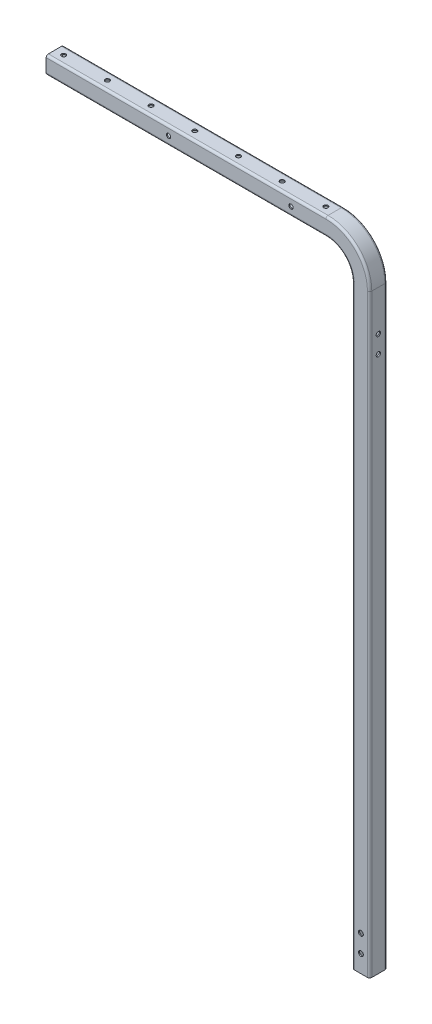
from build123d import *

# Parameters (mm, degrees)
SKETCH2_W                   = 25.4
SKETCH2_H                   = 25.4
FILLET1_R                   = 3.175
SHELL1_T                    = -1.5875
WOOD_HOLE_REACH             = 1041.462
SKETCH3_R                   = 3.175
LPATTERN1_COUNT             = 7
LPATTERN1_PITCH             = 63.5
SKETCH5_R                   = 3.175
CONT_MTG_DEPTH              = 1029.15108812
F_1_4_0_25_DIAMETER_HOLE1_D = 6.35
SKETCH8_R                   = 3.571875
CUT_EXTRUDE1_DEPTH          = 1029.386371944
LPATTERN2_COUNT             = 2
LPATTERN2_PITCH             = 25.4


with BuildPart() as part:
    # Base-Sweep: sweep along a path in Sketch1
    with BuildLine(Plane.XY) as base_sweep_path:
        Line((0, 0), (406.4, 0))
        ThreePointArc((406.4, 0), (442.321024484, -14.878975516), (457.2, -50.8))
        Line((457.2, -50.8), (457.2, -914.4))
    # Sketch2 (on Right Plane) → Base-Sweep (sweep)
    with BuildSketch(Plane(origin=(0, 0, 0), x_dir=(0, 0, -1), z_dir=(1, 0, 0))):
        Rectangle(SKETCH2_W, SKETCH2_H)
    sweep(path=base_sweep_path.line)

    # Fillet1
    fillet1_edges = [part.edges().sort_by_distance(p)[0] for p in [
        (451.301280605, -5.898719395, 12.7),
        (451.301280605, -5.898719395, -12.7),
        (433.340768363, -23.859231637, -12.7),
        (433.340768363, -23.859231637, 12.7),
        (469.9, -482.6, 12.7),
        (469.9, -482.6, -12.7),
        (444.5, -482.6, -12.7),
        (444.5, -482.6, 12.7),
        (203.2, 12.7, 12.7),
        (203.2, 12.7, -12.7),
        (203.2, -12.7, -12.7),
        (203.2, -12.7, 12.7),
    ]]
    fillet(fillet1_edges, radius=FILLET1_R)

    # Shell1
    shell1_openings = [part.faces().sort_by_distance(p)[0] for p in [
        (457.2, -914.4, 0),
        (0, 0, 0),
    ]]
    offset(amount=SHELL1_T, openings=shell1_openings, kind=Kind.INTERSECTION)

    # Sketch3 → Wood Hole (cut, up to next)
    with BuildSketch(Plane(origin=(0, 12.7, 0), x_dir=(-1, 0, 0), z_dir=(0, 1, 0)), mode=Mode.PRIVATE) as wood_hole_sk1:
        with Locations((-12.7, 0)):
            Circle(SKETCH3_R)
    wood_hole_tool1 = extrude(wood_hole_sk1.sketch, amount=-WOOD_HOLE_REACH, mode=Mode.PRIVATE) & part.part
    wood_hole = wood_hole_tool1.solids().sort_by_distance((12.7, 12.7, 0))[0]
    add(wood_hole, mode=Mode.SUBTRACT)

    # LPattern1: Wood Hole ×7
    with Locations(*[(i * LPATTERN1_PITCH, 0, 0) for i in range(1, LPATTERN1_COUNT)]):
        add(wood_hole, mode=Mode.SUBTRACT)

    # Sketch5 → cont_mtg (cut, through all)
    with BuildSketch(Plane(origin=(469.9, 0, 0), x_dir=(0, 0, -1), z_dir=(1, 0, 0))):
        with Locations(Location((0, -109.5375, 0), (0, 0, 90))):
            Circle(SKETCH5_R)
        with Locations(Location((0, -134.9375, 0), (0, 0, 90))):
            Circle(SKETCH5_R)
    extrude(amount=-CONT_MTG_DEPTH, mode=Mode.SUBTRACT)

    # 1_4 _0.25_ Diameter Hole1 (through all)
    with Locations(Plane.XY.offset(12.7)):
        with Locations((177.8, 0), (355.6, 0)):
            Hole(F_1_4_0_25_DIAMETER_HOLE1_D / 2)

    # Sketch8 → Cut-Extrude1 (cut, through all)
    with BuildSketch(Plane(origin=(0, 0, -12.7), x_dir=(-1, 0, 0), z_dir=(0, 0, -1))):
        with Locations(Location((-457.2, -889, 0), (0, 0, 90))):
            Circle(SKETCH8_R)
    cut_extrude1 = extrude(amount=-CUT_EXTRUDE1_DEPTH, mode=Mode.SUBTRACT)

    # LPattern2: Cut-Extrude1 ×2
    with Locations(*[(0, i * LPATTERN2_PITCH, 0) for i in range(1, LPATTERN2_COUNT)]):
        add(cut_extrude1, mode=Mode.SUBTRACT)


solid = part.part
